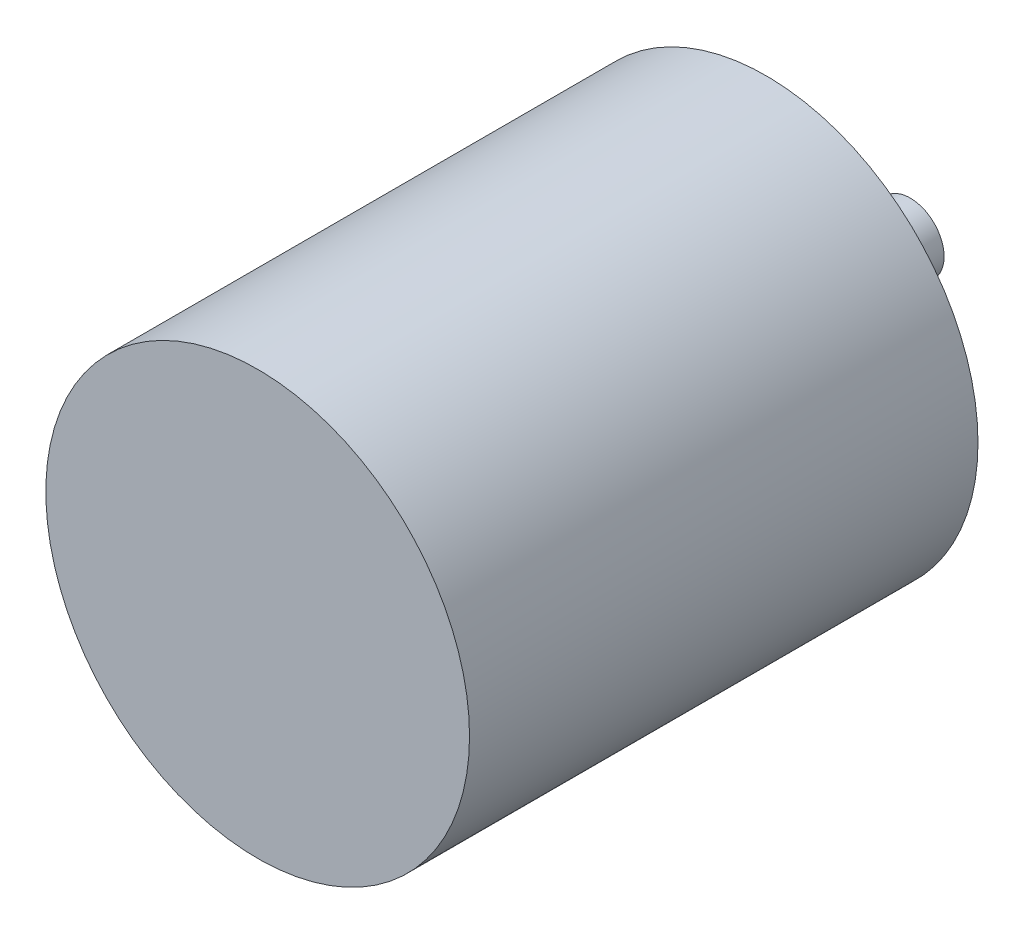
from build123d import *

# Parameters (mm, degrees)
SKETCH2_R           = 25
BOSS_EXTRUDE1_DEPTH = 60
SKETCH3_R           = 4
BOSS_EXTRUDE2_DEPTH = 17
SKETCH4_R           = 3
CUT_EXTRUDE1_DEPTH  = 7


with BuildPart() as part:
    # Sketch2 → Boss-Extrude1 (new body)
    with BuildSketch(Plane.XY):
        Circle(SKETCH2_R)
    extrude(amount=BOSS_EXTRUDE1_DEPTH)

    # Sketch3 → Boss-Extrude2 (add)
    with BuildSketch(Plane.XY):
        Circle(SKETCH3_R)
    extrude(amount=-BOSS_EXTRUDE2_DEPTH)

    # Sketch4 → Cut-Extrude1 (cut)
    with BuildSketch(Plane(origin=(0, 0, 0), x_dir=(-1, 0, 0), z_dir=(0, 0, -1))):
        with Locations((10, 10)):
            Circle(SKETCH4_R)
        with Locations((-10, 10)):
            Circle(SKETCH4_R)
        with Locations((-10, -10)):
            Circle(SKETCH4_R)
        with Locations((10, -10)):
            Circle(SKETCH4_R)
    extrude(amount=-CUT_EXTRUDE1_DEPTH, mode=Mode.SUBTRACT)


solid = part.part
